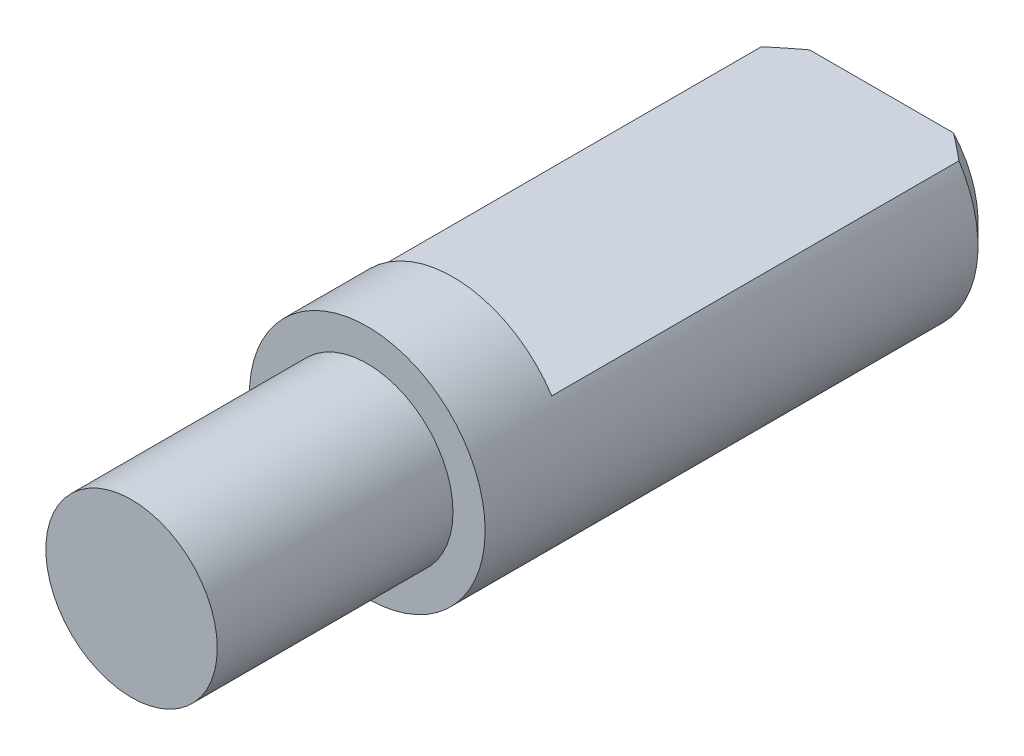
ISO-10303-21;
HEADER;
FILE_DESCRIPTION(('STEP AP214'),'2;1');
FILE_NAME('part.step','',(''),(''),'','','');
FILE_SCHEMA(('AUTOMOTIVE_DESIGN { 1 0 10303 214 1 1 1 1 }'));
ENDSEC;
DATA;
#1=APPLICATION_CONTEXT('core data for automotive mechanical design processes');
#2=APPLICATION_PROTOCOL_DEFINITION('international standard','automotive_design',2000,#1);
#3=PRODUCT_CONTEXT('',#1,'mechanical');
#4=PRODUCT('Part','Part','',(#3));
#5=PRODUCT_RELATED_PRODUCT_CATEGORY('part','',(#4));
#6=PRODUCT_DEFINITION_FORMATION('','',#4);
#7=PRODUCT_DEFINITION_CONTEXT('part definition',#1,'design');
#8=PRODUCT_DEFINITION('design','',#6,#7);
#9=PRODUCT_DEFINITION_SHAPE('','',#8);
#10=(LENGTH_UNIT() NAMED_UNIT(*) SI_UNIT(.MILLI.,.METRE.));
#11=(NAMED_UNIT(*) PLANE_ANGLE_UNIT() SI_UNIT($,.RADIAN.));
#12=(NAMED_UNIT(*) SI_UNIT($,.STERADIAN.) SOLID_ANGLE_UNIT());
#13=UNCERTAINTY_MEASURE_WITH_UNIT(LENGTH_MEASURE(1.E-05),#10,'distance_accuracy_value','');
#14=(GEOMETRIC_REPRESENTATION_CONTEXT(3) GLOBAL_UNCERTAINTY_ASSIGNED_CONTEXT((#13)) GLOBAL_UNIT_ASSIGNED_CONTEXT((#10,
#11,#12)) REPRESENTATION_CONTEXT('',''));
#15=CARTESIAN_POINT('',(0.,0.,0.));
#16=DIRECTION('',(0.,0.,1.));
#17=DIRECTION('',(1.,0.,0.));
#18=AXIS2_PLACEMENT_3D('',#15,#16,#17);
#19=CARTESIAN_POINT('',(0.,0.,48.));
#20=DIRECTION('',(0.,0.,-1.));
#21=DIRECTION('',(-1.,0.,0.));
#22=AXIS2_PLACEMENT_3D('',#19,#20,#21);
#23=CYLINDRICAL_SURFACE('',#22,11.);
#24=CARTESIAN_POINT('',(0.,0.,48.));
#25=DIRECTION('',(0.,0.,1.));
#26=DIRECTION('',(1.,0.,0.));
#27=AXIS2_PLACEMENT_3D('',#24,#25,#26);
#28=CIRCLE('',#27,11.);
#29=CARTESIAN_POINT('',(11.,0.,48.));
#30=VERTEX_POINT('',#29);
#31=EDGE_CURVE('E81',#30,#30,#28,.T.);
#32=ORIENTED_EDGE('',*,*,#31,.F.);
#33=EDGE_LOOP('',(#32));
#34=FACE_BOUND('',#33,.T.);
#35=DIRECTION('',(0.,0.,-1.));
#36=VECTOR('',#35,1.);
#37=CARTESIAN_POINT('',(9.21954445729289,6.,48.));
#38=LINE('',#37,#36);
#39=CARTESIAN_POINT('',(9.21954445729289,6.,40.));
#40=VERTEX_POINT('',#39);
#41=CARTESIAN_POINT('',(9.21954445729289,6.,1.99999999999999));
#42=VERTEX_POINT('',#41);
#43=EDGE_CURVE('E43',#40,#42,#38,.T.);
#44=ORIENTED_EDGE('',*,*,#43,.F.);
#45=CARTESIAN_POINT('',(0.,0.,40.));
#46=DIRECTION('',(0.,0.,-1.));
#47=DIRECTION('',(-1.,0.,0.));
#48=AXIS2_PLACEMENT_3D('',#45,#46,#47);
#49=CIRCLE('',#48,11.);
#50=CARTESIAN_POINT('',(-9.21954445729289,6.,40.));
#51=VERTEX_POINT('',#50);
#52=EDGE_CURVE('E12',#51,#40,#49,.T.);
#53=ORIENTED_EDGE('',*,*,#52,.F.);
#54=DIRECTION('',(0.,0.,-1.));
#55=VECTOR('',#54,1.);
#56=CARTESIAN_POINT('',(-9.21954445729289,6.,48.));
#57=LINE('',#56,#55);
#58=CARTESIAN_POINT('',(-9.21954445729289,6.,1.99999999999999));
#59=VERTEX_POINT('',#58);
#60=EDGE_CURVE('E58',#59,#51,#57,.F.);
#61=ORIENTED_EDGE('',*,*,#60,.F.);
#62=CARTESIAN_POINT('',(0.,0.,1.99999999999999));
#63=DIRECTION('',(0.,0.,1.));
#64=DIRECTION('',(1.,0.,0.));
#65=AXIS2_PLACEMENT_3D('',#62,#63,#64);
#66=CIRCLE('',#65,11.);
#67=EDGE_CURVE('E72',#59,#42,#66,.T.);
#68=ORIENTED_EDGE('',*,*,#67,.T.);
#69=EDGE_LOOP('',(#44,#53,#61,#68));
#70=FACE_BOUND('',#69,.T.);
#71=ADVANCED_FACE('F28',(#34,#70),#23,.T.);
#72=CARTESIAN_POINT('',(0.,0.,0.));
#73=DIRECTION('',(0.,0.,1.));
#74=DIRECTION('',(1.,0.,0.));
#75=AXIS2_PLACEMENT_3D('',#72,#73,#74);
#76=PLANE('',#75);
#77=DIRECTION('',(-1.,0.,0.));
#78=VECTOR('',#77,1.);
#79=CARTESIAN_POINT('',(0.,6.,0.));
#80=LINE('',#79,#78);
#81=CARTESIAN_POINT('',(6.70820393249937,6.,0.));
#82=VERTEX_POINT('',#81);
#83=CARTESIAN_POINT('',(-6.70820393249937,6.,0.));
#84=VERTEX_POINT('',#83);
#85=EDGE_CURVE('E70',#82,#84,#80,.T.);
#86=ORIENTED_EDGE('',*,*,#85,.F.);
#87=CARTESIAN_POINT('',(0.,0.,0.));
#88=DIRECTION('',(0.,0.,1.));
#89=DIRECTION('',(1.,0.,0.));
#90=AXIS2_PLACEMENT_3D('',#87,#88,#89);
#91=CIRCLE('',#90,9.);
#92=EDGE_CURVE('E85',#82,#84,#91,.F.);
#93=ORIENTED_EDGE('',*,*,#92,.T.);
#94=EDGE_LOOP('',(#86,#93));
#95=FACE_BOUND('',#94,.T.);
#96=ADVANCED_FACE('F111',(#95),#76,.F.);
#97=CARTESIAN_POINT('',(0.,0.,1.99999999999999));
#98=DIRECTION('',(0.,0.,1.));
#99=DIRECTION('',(1.,0.,0.));
#100=AXIS2_PLACEMENT_3D('',#97,#98,#99);
#101=CONICAL_SURFACE('',#100,11.,0.785398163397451);
#102=ORIENTED_EDGE('',*,*,#67,.F.);
#103=CARTESIAN_POINT('',(-23.5007921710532,6.,15.2546332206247));
#104=CARTESIAN_POINT('',(-22.9459320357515,6.,14.7170517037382));
#105=CARTESIAN_POINT('',(-22.3905205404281,6.,14.180037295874));
#106=CARTESIAN_POINT('',(-21.2782437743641,6.,13.1074993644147));
#107=CARTESIAN_POINT('',(-20.7213784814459,6.,12.5719758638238));
#108=CARTESIAN_POINT('',(-19.6055123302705,6.,11.5024596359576));
#109=CARTESIAN_POINT('',(-19.0465103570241,6.,10.9684680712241));
#110=CARTESIAN_POINT('',(-17.9262212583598,6.,9.90289520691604));
#111=CARTESIAN_POINT('',(-17.3649341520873,6.,9.3713138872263));
#112=CARTESIAN_POINT('',(-16.2515889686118,6.,8.32281185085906));
#113=CARTESIAN_POINT('',(-15.6995948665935,6.,7.80582328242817));
#114=CARTESIAN_POINT('',(-14.5918064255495,6.,6.77590460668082));
#115=CARTESIAN_POINT('',(-14.0360120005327,6.,6.2629745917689));
#116=CARTESIAN_POINT('',(-12.9194207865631,6.,5.24287833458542));
#117=CARTESIAN_POINT('',(-12.358625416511,6.,4.73571054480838));
#118=CARTESIAN_POINT('',(-11.5119682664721,6.,3.9811100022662));
#119=CARTESIAN_POINT('',(-11.2288438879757,6.,3.73060631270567));
#120=CARTESIAN_POINT('',(-10.6603792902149,6.,3.2321277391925));
#121=CARTESIAN_POINT('',(-10.3750390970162,6.,2.98415282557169));
#122=CARTESIAN_POINT('',(-9.92719767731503,6.,2.59924524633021));
#123=CARTESIAN_POINT('',(-9.76562040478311,6.,2.46123739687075));
#124=CARTESIAN_POINT('',(-9.44150225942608,6.,2.18635764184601));
#125=CARTESIAN_POINT('',(-9.27896138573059,6.,2.04948573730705));
#126=CARTESIAN_POINT('',(-8.78968435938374,6.,1.64078441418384));
#127=CARTESIAN_POINT('',(-8.46132270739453,6.,1.37089432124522));
#128=CARTESIAN_POINT('',(-7.79535083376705,6.,0.835031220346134));
#129=CARTESIAN_POINT('',(-7.45767838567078,6.,0.569135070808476));
#130=CARTESIAN_POINT('',(-6.9455919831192,6.,0.177648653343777));
#131=CARTESIAN_POINT('',(-6.77398203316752,6.,0.0483903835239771));
#132=CARTESIAN_POINT('',(-6.42859849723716,6.,-0.207198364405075));
#133=CARTESIAN_POINT('',(-6.25482497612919,6.,-0.333528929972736));
#134=CARTESIAN_POINT('',(-5.90192743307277,6.,-0.584708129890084));
#135=CARTESIAN_POINT('',(-5.72276235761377,6.,-0.709499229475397));
#136=CARTESIAN_POINT('',(-5.3614268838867,6.,-0.954673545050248));
#137=CARTESIAN_POINT('',(-5.17925643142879,6.,-1.07505668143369));
#138=CARTESIAN_POINT('',(-4.81117040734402,6.,-1.31057082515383));
#139=CARTESIAN_POINT('',(-4.62524985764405,6.,-1.4256940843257));
#140=CARTESIAN_POINT('',(-4.24938035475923,6.,-1.64919079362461));
#141=CARTESIAN_POINT('',(-4.05943151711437,6.,-1.75756443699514));
#142=CARTESIAN_POINT('',(-3.67743799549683,6.,-1.96451045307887));
#143=CARTESIAN_POINT('',(-3.48545300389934,6.,-2.0631922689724));
#144=CARTESIAN_POINT('',(-3.09644774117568,6.,-2.25026626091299));
#145=CARTESIAN_POINT('',(-2.89942660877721,6.,-2.33865666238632));
#146=CARTESIAN_POINT('',(-2.500591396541,6.,-2.50230864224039));
#147=CARTESIAN_POINT('',(-2.29879232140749,6.,-2.57760637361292));
#148=CARTESIAN_POINT('',(-1.89002158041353,6.,-2.71231251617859));
#149=CARTESIAN_POINT('',(-1.68305339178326,6.,-2.77173131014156));
#150=CARTESIAN_POINT('',(-1.27747270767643,6.,-2.86847289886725));
#151=CARTESIAN_POINT('',(-1.0791359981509,6.,-2.9069357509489));
#152=CARTESIAN_POINT('',(-0.679665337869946,6.,-2.96485819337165));
#153=CARTESIAN_POINT('',(-0.478531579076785,6.,-2.98431908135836));
#154=CARTESIAN_POINT('',(-0.0757790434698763,6.,-3.00288524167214));
#155=CARTESIAN_POINT('',(0.125837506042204,6.,-3.00203791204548));
#156=CARTESIAN_POINT('',(0.527970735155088,6.,-2.98016423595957));
#157=CARTESIAN_POINT('',(0.728487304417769,6.,-2.95913590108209));
#158=CARTESIAN_POINT('',(1.12469234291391,6.,-2.89861257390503));
#159=CARTESIAN_POINT('',(1.32040866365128,6.,-2.85929644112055));
#160=CARTESIAN_POINT('',(1.70784284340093,6.,-2.7645043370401));
#161=CARTESIAN_POINT('',(1.89956029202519,6.,-2.70902671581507));
#162=CARTESIAN_POINT('',(2.27944823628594,6.,-2.58412036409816));
#163=CARTESIAN_POINT('',(2.46759524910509,6.,-2.51462093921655));
#164=CARTESIAN_POINT('',(2.74630563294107,6.,-2.40189576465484));
#165=CARTESIAN_POINT('',(2.8386194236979,6.,-2.36291025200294));
#166=CARTESIAN_POINT('',(3.02212153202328,6.,-2.28237954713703));
#167=CARTESIAN_POINT('',(3.11330988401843,6.,-2.24083443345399));
#168=CARTESIAN_POINT('',(3.39517574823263,6.,-2.10806735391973));
#169=CARTESIAN_POINT('',(3.58398665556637,6.,-2.01286966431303));
#170=CARTESIAN_POINT('',(3.95725835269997,6.,-1.81425567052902));
#171=CARTESIAN_POINT('',(4.14171786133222,6.,-1.71083698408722));
#172=CARTESIAN_POINT('',(4.50696251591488,6.,-1.49728442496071));
#173=CARTESIAN_POINT('',(4.68774342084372,6.,-1.38714332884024));
#174=CARTESIAN_POINT('',(5.04590142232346,6.,-1.16151880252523));
#175=CARTESIAN_POINT('',(5.22327883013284,6.,-1.04603586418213));
#176=CARTESIAN_POINT('',(5.5758071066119,6.,-0.81022675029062));
#177=CARTESIAN_POINT('',(5.75094618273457,6.,-0.689882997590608));
#178=CARTESIAN_POINT('',(6.09867127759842,6.,-0.445555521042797));
#179=CARTESIAN_POINT('',(6.27125717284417,6.,-0.321571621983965));
#180=CARTESIAN_POINT('',(6.78550588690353,6.,0.0547385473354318));
#181=CARTESIAN_POINT('',(7.12387307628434,6.,0.311568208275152));
#182=CARTESIAN_POINT('',(7.79844083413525,6.,0.837203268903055));
#183=CARTESIAN_POINT('',(8.13455153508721,6.,1.10612306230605));
#184=CARTESIAN_POINT('',(8.80158251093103,6.,1.65038522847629));
#185=CARTESIAN_POINT('',(9.13250218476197,6.,1.92572833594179));
#186=CARTESIAN_POINT('',(9.78945340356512,6.,2.48052978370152));
#187=CARTESIAN_POINT('',(10.1154950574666,6.,2.75997618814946));
#188=CARTESIAN_POINT('',(10.7643745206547,6.,3.32256839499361));
#189=CARTESIAN_POINT('',(11.0872122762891,6.,3.60571425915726));
#190=CARTESIAN_POINT('',(11.9370533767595,6.,4.35786292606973));
#191=CARTESIAN_POINT('',(12.4618797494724,6.,4.82932353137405));
#192=CARTESIAN_POINT('',(13.5065929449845,6.,5.77769613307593));
#193=CARTESIAN_POINT('',(14.0264796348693,6.,6.25460827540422));
#194=CARTESIAN_POINT('',(15.0630707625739,6.,7.21286608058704));
#195=CARTESIAN_POINT('',(15.5797716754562,6.,7.69421555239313));
#196=CARTESIAN_POINT('',(16.6103732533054,6.,8.65990254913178));
#197=CARTESIAN_POINT('',(17.1242739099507,6.,9.14424008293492));
#198=CARTESIAN_POINT('',(18.129077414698,6.,10.0955065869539));
#199=CARTESIAN_POINT('',(18.6200669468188,6.,10.5623440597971));
#200=CARTESIAN_POINT('',(19.6004424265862,6.,11.4977025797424));
#201=CARTESIAN_POINT('',(20.0898283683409,6.,11.9662236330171));
#202=CARTESIAN_POINT('',(21.0667551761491,6.,12.9040967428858));
#203=CARTESIAN_POINT('',(21.5542974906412,6.,13.3734472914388));
#204=CARTESIAN_POINT('',(22.5283003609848,6.,14.3132623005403));
#205=CARTESIAN_POINT('',(23.0147609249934,6.,14.7837267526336));
#206=CARTESIAN_POINT('',(23.5007921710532,6.,15.2546332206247));
#207=B_SPLINE_CURVE_WITH_KNOTS('',3,(#103,#104,#105,#106,#107,#108,#109,#110,#111,#112,#113,
#114,#115,#116,#117,#118,#119,#120,#121,#122,#123,#124,#125,#126,#127,#128,#129,#130,#131,#132,
#133,#134,#135,#136,#137,#138,#139,#140,#141,#142,#143,#144,#145,#146,#147,#148,#149,#150,#151,
#152,#153,#154,#155,#156,#157,#158,#159,#160,#161,#162,#163,#164,#165,#166,#167,#168,#169,#170,
#171,#172,#173,#174,#175,#176,#177,#178,#179,#180,#181,#182,#183,#184,#185,#186,#187,#188,#189,
#190,#191,#192,#193,#194,#195,#196,#197,#198,#199,#200,#201,#202,#203,#204,#205,#206),
.UNSPECIFIED.,.F.,.F.,(4,2,2,2,2,2,2,2,2,2,2,2,2,2,2,2,2,2,2,2,2,2,2,2,2,2,2,2,2,2,2,2,2,2,2,2,
2,2,2,2,2,2,2,2,2,2,2,2,2,2,2,4),(0.,2.3177101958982,4.63545595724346,6.95464674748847,
9.27381814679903,11.5426726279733,13.8115786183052,16.0798601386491,17.2139584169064,
18.348043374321,18.9855185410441,19.6229942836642,20.898060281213,22.1872956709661,
22.8318014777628,23.4762880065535,24.1312583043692,24.7862404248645,25.4421581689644,
26.0980571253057,26.7453972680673,27.3928488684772,28.0384832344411,28.6836944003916,
29.2889676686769,29.8941995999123,30.4980190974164,31.1018980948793,31.6999913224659,
32.2981456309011,32.8993946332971,33.1999882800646,33.5005727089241,34.1346492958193,
34.7689102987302,35.4038652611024,36.0387618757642,36.6762064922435,37.3136818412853,
38.5878593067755,39.8791195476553,41.1705282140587,42.4587255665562,43.7469444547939,
45.8633567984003,47.9798259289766,50.0983222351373,52.2168248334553,54.2493237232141,
56.2818300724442,58.3120712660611,60.3422970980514),.UNSPECIFIED.);
#208=EDGE_CURVE('E36',#59,#84,#207,.T.);
#209=ORIENTED_EDGE('',*,*,#208,.T.);
#210=ORIENTED_EDGE('',*,*,#92,.F.);
#211=EDGE_CURVE('E87',#82,#42,#207,.T.);
#212=ORIENTED_EDGE('',*,*,#211,.T.);
#213=EDGE_LOOP('',(#102,#209,#210,#212));
#214=FACE_BOUND('',#213,.T.);
#215=ADVANCED_FACE('F93',(#214),#101,.T.);
#216=CARTESIAN_POINT('',(0.,0.,48.));
#217=DIRECTION('',(0.,0.,1.));
#218=DIRECTION('',(1.,0.,0.));
#219=AXIS2_PLACEMENT_3D('',#216,#217,#218);
#220=PLANE('',#219);
#221=CARTESIAN_POINT('',(0.,0.,48.));
#222=DIRECTION('',(0.,0.,1.));
#223=DIRECTION('',(1.,0.,0.));
#224=AXIS2_PLACEMENT_3D('',#221,#222,#223);
#225=CIRCLE('',#224,8.);
#226=CARTESIAN_POINT('',(8.,0.,48.));
#227=VERTEX_POINT('',#226);
#228=EDGE_CURVE('E78',#227,#227,#225,.T.);
#229=ORIENTED_EDGE('',*,*,#228,.F.);
#230=EDGE_LOOP('',(#229));
#231=FACE_BOUND('',#230,.T.);
#232=ORIENTED_EDGE('',*,*,#31,.T.);
#233=EDGE_LOOP('',(#232));
#234=FACE_BOUND('',#233,.T.);
#235=ADVANCED_FACE('F104',(#231,#234),#220,.T.);
#236=CARTESIAN_POINT('',(0.,0.,48.));
#237=DIRECTION('',(0.,0.,1.));
#238=DIRECTION('',(1.,0.,0.));
#239=AXIS2_PLACEMENT_3D('',#236,#237,#238);
#240=CYLINDRICAL_SURFACE('',#239,8.);
#241=ORIENTED_EDGE('',*,*,#228,.T.);
#242=EDGE_LOOP('',(#241));
#243=FACE_BOUND('',#242,.T.);
#244=CARTESIAN_POINT('',(0.,0.,70.));
#245=DIRECTION('',(0.,0.,1.));
#246=DIRECTION('',(1.,0.,0.));
#247=AXIS2_PLACEMENT_3D('',#244,#245,#246);
#248=CIRCLE('',#247,8.);
#249=CARTESIAN_POINT('',(8.,0.,70.));
#250=VERTEX_POINT('',#249);
#251=EDGE_CURVE('E66',#250,#250,#248,.T.);
#252=ORIENTED_EDGE('',*,*,#251,.F.);
#253=EDGE_LOOP('',(#252));
#254=FACE_BOUND('',#253,.T.);
#255=ADVANCED_FACE('F102',(#243,#254),#240,.T.);
#256=CARTESIAN_POINT('',(0.,0.,70.));
#257=DIRECTION('',(0.,0.,1.));
#258=DIRECTION('',(1.,0.,0.));
#259=AXIS2_PLACEMENT_3D('',#256,#257,#258);
#260=PLANE('',#259);
#261=ORIENTED_EDGE('',*,*,#251,.T.);
#262=EDGE_LOOP('',(#261));
#263=FACE_BOUND('',#262,.T.);
#264=ADVANCED_FACE('F30',(#263),#260,.T.);
#265=CARTESIAN_POINT('',(21.3487345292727,54.,40.));
#266=DIRECTION('',(0.,0.,-1.));
#267=DIRECTION('',(-1.,0.,0.));
#268=AXIS2_PLACEMENT_3D('',#265,#266,#267);
#269=PLANE('',#268);
#270=ORIENTED_EDGE('',*,*,#52,.T.);
#271=DIRECTION('',(1.,0.,0.));
#272=VECTOR('',#271,1.);
#273=CARTESIAN_POINT('',(21.3487345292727,6.,40.));
#274=LINE('',#273,#272);
#275=EDGE_CURVE('E61',#51,#40,#274,.T.);
#276=ORIENTED_EDGE('',*,*,#275,.F.);
#277=EDGE_LOOP('',(#270,#276));
#278=FACE_BOUND('',#277,.T.);
#279=ADVANCED_FACE('F69',(#278),#269,.T.);
#280=CARTESIAN_POINT('',(21.3487345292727,6.,-4.61149353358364));
#281=DIRECTION('',(0.,1.,0.));
#282=DIRECTION('',(0.,0.,1.));
#283=AXIS2_PLACEMENT_3D('',#280,#281,#282);
#284=PLANE('',#283);
#285=ORIENTED_EDGE('',*,*,#60,.T.);
#286=ORIENTED_EDGE('',*,*,#275,.T.);
#287=ORIENTED_EDGE('',*,*,#43,.T.);
#288=ORIENTED_EDGE('',*,*,#211,.F.);
#289=ORIENTED_EDGE('',*,*,#85,.T.);
#290=ORIENTED_EDGE('',*,*,#208,.F.);
#291=EDGE_LOOP('',(#285,#286,#287,#288,#289,#290));
#292=FACE_BOUND('',#291,.T.);
#293=ADVANCED_FACE('F60',(#292),#284,.T.);
#294=CLOSED_SHELL('',(#71,#96,#215,#235,#255,#264,#279,#293));
#295=MANIFOLD_SOLID_BREP('B2',#294);
#296=ADVANCED_BREP_SHAPE_REPRESENTATION('',(#18,#295),#14);
#297=SHAPE_DEFINITION_REPRESENTATION(#9,#296);
ENDSEC;
END-ISO-10303-21;
